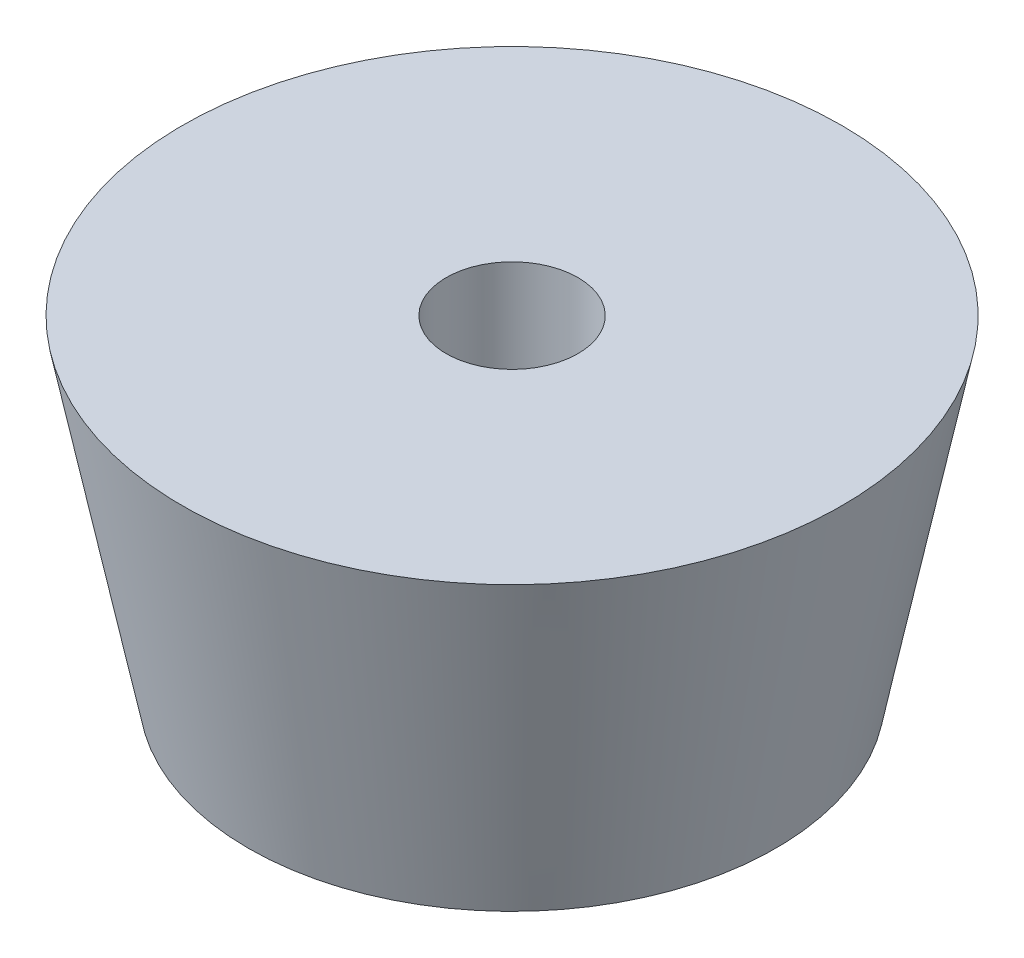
from build123d import *

# Parameters (mm, degrees)
CUT_EXTRUDE1_DEPTH = 8.255


with BuildPart() as part:
    # Sketch1 → Revolve1 (revolve)
    with BuildSketch(Plane(origin=(0, 0, 0), x_dir=(0, 0, -1), z_dir=(1, 0, 0)), mode=Mode.PRIVATE) as revolve1_sk:
        Polygon((-3.175, 15.875), (-3.175, 0), (-12.7, 0), (-15.875, 15.875), align=None)
    revolve(revolve1_sk.sketch.rotate(Axis((0, 0, 0), (0, 1, 0)), 180), axis=Axis((0, 0, 0), (0, 1, 0)))

    # Sketch3 → Cut-Extrude1 (cut)
    with BuildSketch(Plane.XZ):
        with BuildLine():
            Line((-6.472113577, 0.219970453), (-3.426556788, 5.495029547))
            ThreePointArc((-3.426556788, 5.495029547), (-3.426556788, 5.934970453), (-3.045556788, 5.715))
            Line((-3.045556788, 5.715), (3.045556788, 5.715))
            ThreePointArc((3.045556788, 5.715), (3.426556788, 5.934970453), (3.426556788, 5.495029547))
            Line((3.426556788, 5.495029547), (6.472113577, 0.219970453))
            ThreePointArc((6.472113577, 0.219970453), (6.853113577, 0), (6.472113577, -0.219970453))
            Line((6.472113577, -0.219970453), (3.426556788, -5.495029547))
            ThreePointArc((3.426556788, -5.495029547), (3.426556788, -5.934970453), (3.045556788, -5.715))
            Line((3.045556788, -5.715), (-3.045556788, -5.715))
            ThreePointArc((-3.045556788, -5.715), (-3.426556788, -5.934970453), (-3.426556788, -5.495029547))
            Line((-3.426556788, -5.495029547), (-6.472113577, -0.219970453))
            ThreePointArc((-6.472113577, -0.219970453), (-6.853113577, 0), (-6.472113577, 0.219970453))
        make_face()
    extrude(amount=-CUT_EXTRUDE1_DEPTH, mode=Mode.SUBTRACT)


solid = part.part
